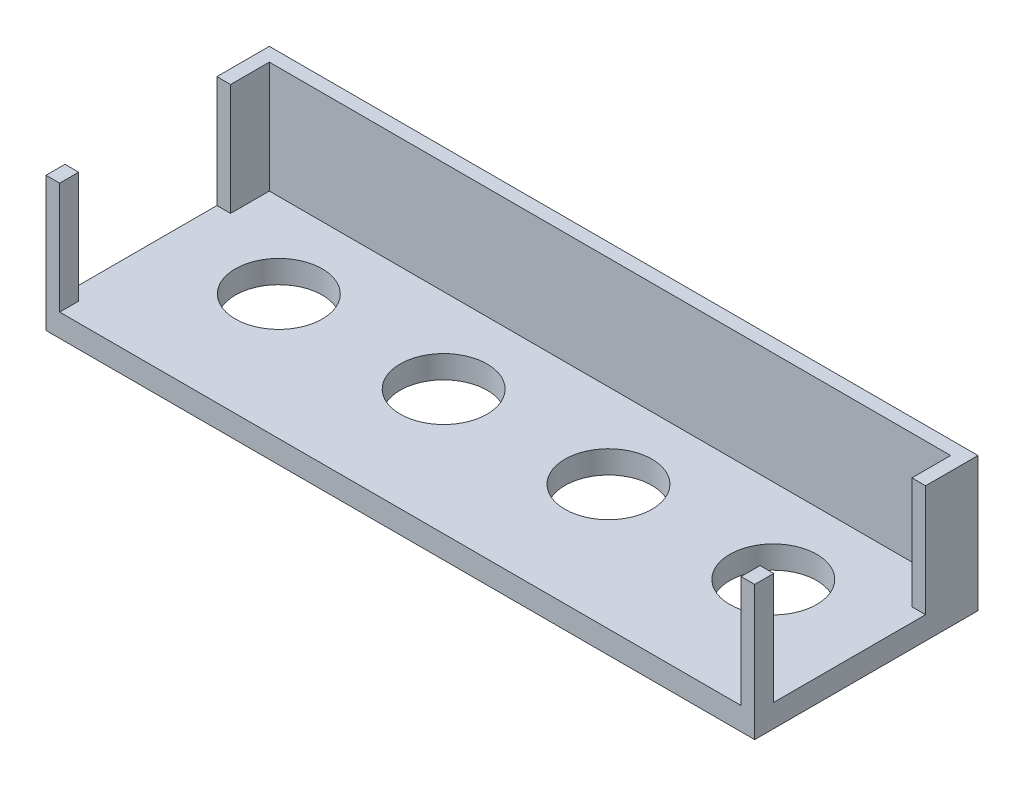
from build123d import *

# Parameters (mm, degrees)
CROQUIS1_W                 = 89.3
CROQUIS1_H                 = 54.8
CROQUIS1_R                 = 5.725
SALIENTE_EXTRUIR1_DEPTH    = 3
CROQUIS2_W                 = 93.3
CROQUIS2_H                 = 58.8
CROQUIS2_W_2               = 89.3
CROQUIS2_H_2               = 54.8
SALIENTE_EXTRUIR2_DEPTH    = 17.7
CORTAR_EXTRUIR3_DEPTH      = 109.973483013
CORTAR_EXTRUIR3_DEPTH_BACK = 109.973483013
CROQUIS4_W                 = 20
CROQUIS4_H                 = 5
CROQUIS5_W                 = 93.3
CROQUIS5_H                 = 29.4
CORTAR_EXTRUIR4_DEPTH      = 109.973483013
CORTAR_EXTRUIR5_REACH      = 110.973
CROQUIS7_W                 = 89.7
CROQUIS7_H                 = 27.8
CORTAR_EXTRUIR6_DEPTH      = 109.973483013
CORTAR_EXTRUIR6_DEPTH_BACK = 109.973483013
CROQUIS8_W                 = 20
CROQUIS8_H                 = 16.346731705


with BuildPart() as part:
    # Croquis1 → Saliente-Extruir1 (new body)
    with BuildSketch(Plane(origin=(0, 0, 0), x_dir=(1, 0, 0), z_dir=(0, 1, 0))):
        with Locations((44.65, 27.4)):
            Rectangle(CROQUIS1_W, CROQUIS1_H)
        with Locations(Location((12.15, 43.9, 0), (0, 0, 270))):
            Circle(CROQUIS1_R, mode=Mode.SUBTRACT)
        with Locations(Location((33.85, 43.9, 0), (0, 0, 270))):
            Circle(CROQUIS1_R, mode=Mode.SUBTRACT)
        with Locations(Location((55.55, 43.9, 0), (0, 0, 270))):
            Circle(CROQUIS1_R, mode=Mode.SUBTRACT)
        with Locations(Location((77.25, 43.9, 0), (0, 0, 270))):
            Circle(CROQUIS1_R, mode=Mode.SUBTRACT)
    extrude(amount=SALIENTE_EXTRUIR1_DEPTH)

    # Croquis2 → Saliente-Extruir2 (add)
    with BuildSketch(Plane(origin=(0, 0, 0), x_dir=(1, 0, 0), z_dir=(0, 1, 0))):
        with Locations((44.65, 27.4)):
            Rectangle(CROQUIS2_W, CROQUIS2_H)
        with Locations((44.65, 27.4)):
            Rectangle(CROQUIS2_W_2, CROQUIS2_H_2, mode=Mode.SUBTRACT)
    extrude(amount=SALIENTE_EXTRUIR2_DEPTH)

    # Croquis4 → Cortar-Extruir3 (cut, two sides: drawn at the far end of the back side and taken through both)
    with BuildSketch(Plane(origin=(0, 0, 0), x_dir=(0, 0, -1), z_dir=(1, 0, 0)).offset(-CORTAR_EXTRUIR3_DEPTH_BACK)):
        with Locations((39.9, 5.5)):
            Rectangle(CROQUIS4_W, CROQUIS4_H)
    extrude(amount=CORTAR_EXTRUIR3_DEPTH + CORTAR_EXTRUIR3_DEPTH_BACK, mode=Mode.SUBTRACT)

    # Croquis5 → Cortar-Extruir4 (cut, through all)
    with BuildSketch(Plane(origin=(0, 0, 0), x_dir=(1, 0, 0), z_dir=(0, 1, 0))):
        with Locations((44.65, 12.7)):
            Rectangle(CROQUIS5_W, CROQUIS5_H)
    extrude(amount=CORTAR_EXTRUIR4_DEPTH, mode=Mode.SUBTRACT)

    # Cortar-Extruir5: up to this face of the body (flat: up to its plane)
    cortar_extruir5_end = Plane(part.part.faces().sort_by_distance((44.640262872, 3, -40.509329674))[0])
    # Croquis7 → Cortar-Extruir5 (cut, up to the picked face)
    with BuildSketch(Plane(origin=(0, 17.7, 0), x_dir=(1, 0, 0), z_dir=(0, 1, 0)), mode=Mode.PRIVATE) as cortar_extruir5_sk1:
        with Locations((44.65, 41.1)):
            Rectangle(CROQUIS7_W, CROQUIS7_H)
    cortar_extruir5_tool1 = split(extrude(cortar_extruir5_sk1.sketch, amount=-CORTAR_EXTRUIR5_REACH, mode=Mode.PRIVATE), bisect_by=cortar_extruir5_end, keep=Keep.BOTH, mode=Mode.PRIVATE)
    add(cortar_extruir5_tool1.solids().sort_by(Axis((44.65, 17.7, -41.1), (0, -1, 0)))[0], mode=Mode.SUBTRACT)

    # Croquis8 → Cortar-Extruir6 (cut, two sides: drawn at the far end of the back side and taken through both)
    with BuildSketch(Plane(origin=(0, 0, 0), x_dir=(0, 0, -1), z_dir=(1, 0, 0)).offset(-CORTAR_EXTRUIR6_DEPTH_BACK)):
        with Locations((39.9, 16.173365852)):
            Rectangle(CROQUIS8_W, CROQUIS8_H)
    extrude(amount=CORTAR_EXTRUIR6_DEPTH + CORTAR_EXTRUIR6_DEPTH_BACK, mode=Mode.SUBTRACT)


solid = part.part
